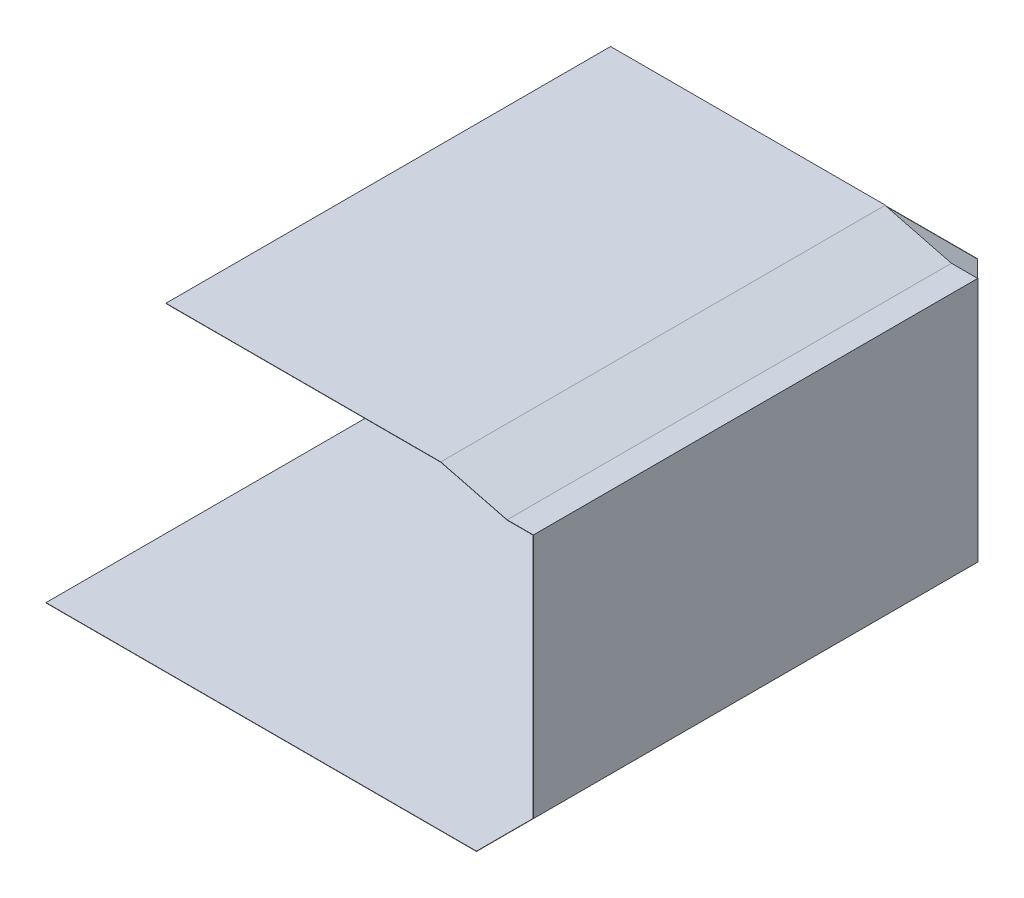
ISO-10303-21;
HEADER;
FILE_DESCRIPTION(('STEP AP214'),'2;1');
FILE_NAME('part.step','',(''),(''),'','','');
FILE_SCHEMA(('AUTOMOTIVE_DESIGN { 1 0 10303 214 1 1 1 1 }'));
ENDSEC;
DATA;
#1=APPLICATION_CONTEXT('core data for automotive mechanical design processes');
#2=APPLICATION_PROTOCOL_DEFINITION('international standard','automotive_design',2000,#1);
#3=PRODUCT_CONTEXT('',#1,'mechanical');
#4=PRODUCT('Part','Part','',(#3));
#5=PRODUCT_RELATED_PRODUCT_CATEGORY('part','',(#4));
#6=PRODUCT_DEFINITION_FORMATION('','',#4);
#7=PRODUCT_DEFINITION_CONTEXT('part definition',#1,'design');
#8=PRODUCT_DEFINITION('design','',#6,#7);
#9=PRODUCT_DEFINITION_SHAPE('','',#8);
#10=(LENGTH_UNIT() NAMED_UNIT(*) SI_UNIT(.MILLI.,.METRE.));
#11=(NAMED_UNIT(*) PLANE_ANGLE_UNIT() SI_UNIT($,.RADIAN.));
#12=(NAMED_UNIT(*) SI_UNIT($,.STERADIAN.) SOLID_ANGLE_UNIT());
#13=UNCERTAINTY_MEASURE_WITH_UNIT(LENGTH_MEASURE(1.E-05),#10,'distance_accuracy_value','');
#14=(GEOMETRIC_REPRESENTATION_CONTEXT(3) GLOBAL_UNCERTAINTY_ASSIGNED_CONTEXT((#13)) GLOBAL_UNIT_ASSIGNED_CONTEXT((#10,
#11,#12)) REPRESENTATION_CONTEXT('',''));
#15=CARTESIAN_POINT('',(0.,0.,0.));
#16=DIRECTION('',(0.,0.,1.));
#17=DIRECTION('',(1.,0.,0.));
#18=AXIS2_PLACEMENT_3D('',#15,#16,#17);
#19=CARTESIAN_POINT('',(328.732673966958,30.0898192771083,3657.6));
#20=DIRECTION('',(0.,1.,0.));
#21=DIRECTION('',(0.,0.,1.));
#22=AXIS2_PLACEMENT_3D('',#19,#20,#21);
#23=PLANE('',#22);
#24=DIRECTION('',(0.,0.,-1.));
#25=VECTOR('',#24,1.);
#26=CARTESIAN_POINT('',(328.732673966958,30.0898192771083,3657.6));
#27=LINE('',#26,#25);
#28=CARTESIAN_POINT('',(328.732673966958,30.0898192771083,3657.6));
#29=VERTEX_POINT('',#28);
#30=CARTESIAN_POINT('',(328.732673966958,30.0898192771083,2.54000000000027));
#31=VERTEX_POINT('',#30);
#32=EDGE_CURVE('E274',#29,#31,#27,.T.);
#33=ORIENTED_EDGE('',*,*,#32,.T.);
#34=DIRECTION('',(1.,0.,0.));
#35=VECTOR('',#34,1.);
#36=CARTESIAN_POINT('',(328.732673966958,30.0898192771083,2.54000000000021));
#37=LINE('',#36,#35);
#38=CARTESIAN_POINT('',(542.412409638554,30.0898192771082,2.54000000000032));
#39=VERTEX_POINT('',#38);
#40=EDGE_CURVE('E221',#31,#39,#37,.T.);
#41=ORIENTED_EDGE('',*,*,#40,.T.);
#42=DIRECTION('',(0.,0.,-1.));
#43=VECTOR('',#42,1.);
#44=CARTESIAN_POINT('',(542.412409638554,30.0898192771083,3657.6));
#45=LINE('',#44,#43);
#46=CARTESIAN_POINT('',(542.412409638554,30.0898192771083,3657.6));
#47=VERTEX_POINT('',#46);
#48=EDGE_CURVE('E60',#47,#39,#45,.T.);
#49=ORIENTED_EDGE('',*,*,#48,.F.);
#50=DIRECTION('',(1.,0.,0.));
#51=VECTOR('',#50,1.);
#52=CARTESIAN_POINT('',(328.732673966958,30.0898192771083,3657.6));
#53=LINE('',#52,#51);
#54=EDGE_CURVE('E242',#29,#47,#53,.T.);
#55=ORIENTED_EDGE('',*,*,#54,.F.);
#56=EDGE_LOOP('',(#33,#41,#49,#55));
#57=FACE_BOUND('',#56,.T.);
#58=ADVANCED_FACE('F37',(#57),#23,.F.);
#59=CARTESIAN_POINT('',(-2477.64759036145,172.329819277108,3657.6));
#60=DIRECTION('',(1.,0.,0.));
#61=DIRECTION('',(0.,0.,-1.));
#62=AXIS2_PLACEMENT_3D('',#59,#60,#61);
#63=PLANE('',#62);
#64=DIRECTION('',(0.,-1.,0.));
#65=VECTOR('',#64,1.);
#66=CARTESIAN_POINT('',(-2477.64759036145,172.329819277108,0.));
#67=LINE('',#66,#65);
#68=CARTESIAN_POINT('',(-2477.64759036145,172.329819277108,0.));
#69=VERTEX_POINT('',#68);
#70=CARTESIAN_POINT('',(-2477.64759036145,-1986.03518072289,0.));
#71=VERTEX_POINT('',#70);
#72=EDGE_CURVE('E233',#69,#71,#67,.T.);
#73=ORIENTED_EDGE('',*,*,#72,.T.);
#74=DIRECTION('',(0.,0.,1.));
#75=VECTOR('',#74,1.);
#76=CARTESIAN_POINT('',(-2477.64759036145,-1986.03518072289,0.));
#77=LINE('',#76,#75);
#78=CARTESIAN_POINT('',(-2477.64759036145,-1986.03518072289,2.53999999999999));
#79=VERTEX_POINT('',#78);
#80=EDGE_CURVE('E183',#71,#79,#77,.T.);
#81=ORIENTED_EDGE('',*,*,#80,.T.);
#82=DIRECTION('',(0.,-1.,0.));
#83=VECTOR('',#82,1.);
#84=CARTESIAN_POINT('',(-2477.64759036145,3189.85088740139,2.53999999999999));
#85=LINE('',#84,#83);
#86=CARTESIAN_POINT('',(-2477.64759036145,169.789819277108,2.53999999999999));
#87=VERTEX_POINT('',#86);
#88=EDGE_CURVE('E201',#87,#79,#85,.T.);
#89=ORIENTED_EDGE('',*,*,#88,.F.);
#90=DIRECTION('',(0.,0.,-1.));
#91=VECTOR('',#90,1.);
#92=CARTESIAN_POINT('',(-2477.64759036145,169.789819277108,3657.6));
#93=LINE('',#92,#91);
#94=CARTESIAN_POINT('',(-2477.64759036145,169.789819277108,3657.6));
#95=VERTEX_POINT('',#94);
#96=EDGE_CURVE('E11',#95,#87,#93,.T.);
#97=ORIENTED_EDGE('',*,*,#96,.F.);
#98=DIRECTION('',(0.,-1.,0.));
#99=VECTOR('',#98,1.);
#100=CARTESIAN_POINT('',(-2477.64759036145,172.329819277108,3657.6));
#101=LINE('',#100,#99);
#102=CARTESIAN_POINT('',(-2477.64759036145,172.329819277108,3657.6));
#103=VERTEX_POINT('',#102);
#104=EDGE_CURVE('E234',#103,#95,#101,.T.);
#105=ORIENTED_EDGE('',*,*,#104,.F.);
#106=DIRECTION('',(0.,0.,-1.));
#107=VECTOR('',#106,1.);
#108=CARTESIAN_POINT('',(-2477.64759036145,172.329819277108,3657.6));
#109=LINE('',#108,#107);
#110=EDGE_CURVE('E252',#103,#69,#109,.T.);
#111=ORIENTED_EDGE('',*,*,#110,.T.);
#112=EDGE_LOOP('',(#73,#81,#89,#97,#105,#111));
#113=FACE_BOUND('',#112,.T.);
#114=ADVANCED_FACE('F39',(#113),#63,.F.);
#115=CARTESIAN_POINT('',(-2477.64759036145,169.789819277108,3657.6));
#116=DIRECTION('',(0.,1.,0.));
#117=DIRECTION('',(0.,0.,1.));
#118=AXIS2_PLACEMENT_3D('',#115,#116,#117);
#119=PLANE('',#118);
#120=ORIENTED_EDGE('',*,*,#96,.T.);
#121=DIRECTION('',(-1.,0.,0.));
#122=VECTOR('',#121,1.);
#123=CARTESIAN_POINT('',(0.,169.789819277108,2.54000000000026));
#124=LINE('',#123,#122);
#125=CARTESIAN_POINT('',(-217.367326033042,169.789819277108,2.54000000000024));
#126=VERTEX_POINT('',#125);
#127=EDGE_CURVE('E186',#126,#87,#124,.T.);
#128=ORIENTED_EDGE('',*,*,#127,.F.);
#129=DIRECTION('',(0.,0.,-1.));
#130=VECTOR('',#129,1.);
#131=CARTESIAN_POINT('',(-217.367326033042,169.789819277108,3657.6));
#132=LINE('',#131,#130);
#133=CARTESIAN_POINT('',(-217.367326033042,169.789819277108,3657.6));
#134=VERTEX_POINT('',#133);
#135=EDGE_CURVE('E45',#134,#126,#132,.T.);
#136=ORIENTED_EDGE('',*,*,#135,.F.);
#137=DIRECTION('',(1.,0.,0.));
#138=VECTOR('',#137,1.);
#139=CARTESIAN_POINT('',(-2477.64759036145,169.789819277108,3657.6));
#140=LINE('',#139,#138);
#141=EDGE_CURVE('E237',#95,#134,#140,.T.);
#142=ORIENTED_EDGE('',*,*,#141,.F.);
#143=EDGE_LOOP('',(#120,#128,#136,#142));
#144=FACE_BOUND('',#143,.T.);
#145=ADVANCED_FACE('F284',(#144),#119,.F.);
#146=CARTESIAN_POINT('',(-217.367326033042,169.789819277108,3657.6));
#147=DIRECTION('',(0.247833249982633,0.968802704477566,0.));
#148=DIRECTION('',(-0.968802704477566,0.247833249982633,0.));
#149=AXIS2_PLACEMENT_3D('',#146,#147,#148);
#150=PLANE('',#149);
#151=ORIENTED_EDGE('',*,*,#135,.T.);
#152=DIRECTION('',(0.968802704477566,-0.247833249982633,0.));
#153=VECTOR('',#152,1.);
#154=CARTESIAN_POINT('',(-217.367326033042,169.789819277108,2.54000000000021));
#155=LINE('',#154,#153);
#156=EDGE_CURVE('E218',#126,#31,#155,.T.);
#157=ORIENTED_EDGE('',*,*,#156,.T.);
#158=ORIENTED_EDGE('',*,*,#32,.F.);
#159=DIRECTION('',(0.968802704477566,-0.247833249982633,0.));
#160=VECTOR('',#159,1.);
#161=CARTESIAN_POINT('',(-217.367326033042,169.789819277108,3657.6));
#162=LINE('',#161,#160);
#163=EDGE_CURVE('E240',#134,#29,#162,.T.);
#164=ORIENTED_EDGE('',*,*,#163,.F.);
#165=EDGE_LOOP('',(#151,#157,#158,#164));
#166=FACE_BOUND('',#165,.T.);
#167=ADVANCED_FACE('F280',(#166),#150,.F.);
#168=CARTESIAN_POINT('',(544.952409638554,32.6298192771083,3657.6));
#169=DIRECTION('',(-1.,0.,0.));
#170=DIRECTION('',(0.,0.,1.));
#171=AXIS2_PLACEMENT_3D('',#168,#169,#170);
#172=PLANE('',#171);
#173=DIRECTION('',(0.,1.,0.));
#174=VECTOR('',#173,1.);
#175=CARTESIAN_POINT('',(544.952409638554,32.6298192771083,0.));
#176=LINE('',#175,#174);
#177=CARTESIAN_POINT('',(544.952409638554,-1988.57518072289,0.));
#178=VERTEX_POINT('',#177);
#179=CARTESIAN_POINT('',(544.952409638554,32.6298192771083,0.));
#180=VERTEX_POINT('',#179);
#181=EDGE_CURVE('E255',#178,#180,#176,.T.);
#182=ORIENTED_EDGE('',*,*,#181,.T.);
#183=DIRECTION('',(0.,0.,-1.));
#184=VECTOR('',#183,1.);
#185=CARTESIAN_POINT('',(544.952409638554,32.6298192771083,3657.6));
#186=LINE('',#185,#184);
#187=CARTESIAN_POINT('',(544.952409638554,32.6298192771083,3657.6));
#188=VERTEX_POINT('',#187);
#189=EDGE_CURVE('E271',#188,#180,#186,.T.);
#190=ORIENTED_EDGE('',*,*,#189,.F.);
#191=DIRECTION('',(0.,1.,0.));
#192=VECTOR('',#191,1.);
#193=CARTESIAN_POINT('',(544.952409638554,32.6298192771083,3657.6));
#194=LINE('',#193,#192);
#195=CARTESIAN_POINT('',(544.952409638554,-1986.03518072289,3657.6));
#196=VERTEX_POINT('',#195);
#197=EDGE_CURVE('E244',#196,#188,#194,.T.);
#198=ORIENTED_EDGE('',*,*,#197,.F.);
#199=DIRECTION('',(0.,0.,1.));
#200=VECTOR('',#199,1.);
#201=CARTESIAN_POINT('',(544.952409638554,-1986.03518072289,0.));
#202=LINE('',#201,#200);
#203=CARTESIAN_POINT('',(544.952409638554,-1986.03518072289,4125.58962890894));
#204=VERTEX_POINT('',#203);
#205=EDGE_CURVE('E181',#196,#204,#202,.T.);
#206=ORIENTED_EDGE('',*,*,#205,.T.);
#207=DIRECTION('',(0.,1.,0.));
#208=VECTOR('',#207,1.);
#209=CARTESIAN_POINT('',(544.952409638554,-1988.57518072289,4125.58962890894));
#210=LINE('',#209,#208);
#211=CARTESIAN_POINT('',(544.952409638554,-1988.57518072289,4125.58962890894));
#212=VERTEX_POINT('',#211);
#213=EDGE_CURVE('E163',#212,#204,#210,.T.);
#214=ORIENTED_EDGE('',*,*,#213,.F.);
#215=DIRECTION('',(0.,0.,1.));
#216=VECTOR('',#215,1.);
#217=CARTESIAN_POINT('',(544.952409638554,-1988.57518072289,0.));
#218=LINE('',#217,#216);
#219=EDGE_CURVE('E169',#178,#212,#218,.T.);
#220=ORIENTED_EDGE('',*,*,#219,.F.);
#221=EDGE_LOOP('',(#182,#190,#198,#206,#214,#220));
#222=FACE_BOUND('',#221,.T.);
#223=ADVANCED_FACE('F179',(#222),#172,.F.);
#224=CARTESIAN_POINT('',(329.052409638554,32.6298192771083,3657.6));
#225=DIRECTION('',(0.,-1.,0.));
#226=DIRECTION('',(0.,0.,-1.));
#227=AXIS2_PLACEMENT_3D('',#224,#225,#226);
#228=PLANE('',#227);
#229=DIRECTION('',(0.,0.,-1.));
#230=VECTOR('',#229,1.);
#231=CARTESIAN_POINT('',(542.412409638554,32.6298192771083,3657.6));
#232=LINE('',#231,#230);
#233=CARTESIAN_POINT('',(542.412409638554,32.6298192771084,2.54000000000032));
#234=VERTEX_POINT('',#233);
#235=CARTESIAN_POINT('',(542.412409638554,32.6298192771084,0.));
#236=VERTEX_POINT('',#235);
#237=EDGE_CURVE('E197',#234,#236,#232,.T.);
#238=ORIENTED_EDGE('',*,*,#237,.F.);
#239=DIRECTION('',(-1.,0.,0.));
#240=VECTOR('',#239,1.);
#241=CARTESIAN_POINT('',(329.052409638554,32.6298192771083,2.54000000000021));
#242=LINE('',#241,#240);
#243=CARTESIAN_POINT('',(329.052409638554,32.6298192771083,2.54000000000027));
#244=VERTEX_POINT('',#243);
#245=EDGE_CURVE('E215',#234,#244,#242,.T.);
#246=ORIENTED_EDGE('',*,*,#245,.T.);
#247=DIRECTION('',(0.,0.,-1.));
#248=VECTOR('',#247,1.);
#249=CARTESIAN_POINT('',(329.052409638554,32.6298192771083,3657.6));
#250=LINE('',#249,#248);
#251=CARTESIAN_POINT('',(329.052409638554,32.6298192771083,3657.6));
#252=VERTEX_POINT('',#251);
#253=EDGE_CURVE('E268',#252,#244,#250,.T.);
#254=ORIENTED_EDGE('',*,*,#253,.F.);
#255=DIRECTION('',(-1.,0.,0.));
#256=VECTOR('',#255,1.);
#257=CARTESIAN_POINT('',(329.052409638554,32.6298192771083,3657.6));
#258=LINE('',#257,#256);
#259=EDGE_CURVE('E246',#188,#252,#258,.T.);
#260=ORIENTED_EDGE('',*,*,#259,.F.);
#261=ORIENTED_EDGE('',*,*,#189,.T.);
#262=DIRECTION('',(-1.,0.,0.));
#263=VECTOR('',#262,1.);
#264=CARTESIAN_POINT('',(329.052409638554,32.6298192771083,0.));
#265=LINE('',#264,#263);
#266=EDGE_CURVE('E257',#180,#236,#265,.T.);
#267=ORIENTED_EDGE('',*,*,#266,.T.);
#268=EDGE_LOOP('',(#238,#246,#254,#260,#261,#267));
#269=FACE_BOUND('',#268,.T.);
#270=ADVANCED_FACE('F319',(#269),#228,.F.);
#271=CARTESIAN_POINT('',(-217.047590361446,172.329819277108,3657.6));
#272=DIRECTION('',(-0.247833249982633,-0.968802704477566,0.));
#273=DIRECTION('',(0.968802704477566,-0.247833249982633,0.));
#274=AXIS2_PLACEMENT_3D('',#271,#272,#273);
#275=PLANE('',#274);
#276=ORIENTED_EDGE('',*,*,#253,.T.);
#277=DIRECTION('',(-0.968802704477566,0.247833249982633,0.));
#278=VECTOR('',#277,1.);
#279=CARTESIAN_POINT('',(-217.047590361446,172.329819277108,2.54000000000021));
#280=LINE('',#279,#278);
#281=CARTESIAN_POINT('',(-207.118499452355,169.789819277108,2.54000000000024));
#282=VERTEX_POINT('',#281);
#283=EDGE_CURVE('E212',#244,#282,#280,.T.);
#284=ORIENTED_EDGE('',*,*,#283,.T.);
#285=DIRECTION('',(0.,0.,-1.));
#286=VECTOR('',#285,1.);
#287=CARTESIAN_POINT('',(-207.118499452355,169.789819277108,3657.6));
#288=LINE('',#287,#286);
#289=CARTESIAN_POINT('',(-207.118499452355,169.789819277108,0.));
#290=VERTEX_POINT('',#289);
#291=EDGE_CURVE('E223',#282,#290,#288,.T.);
#292=ORIENTED_EDGE('',*,*,#291,.T.);
#293=DIRECTION('',(-0.968802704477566,0.247833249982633,0.));
#294=VECTOR('',#293,1.);
#295=CARTESIAN_POINT('',(-217.047590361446,172.329819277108,0.));
#296=LINE('',#295,#294);
#297=CARTESIAN_POINT('',(-217.047590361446,172.329819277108,0.));
#298=VERTEX_POINT('',#297);
#299=EDGE_CURVE('E260',#290,#298,#296,.T.);
#300=ORIENTED_EDGE('',*,*,#299,.T.);
#301=DIRECTION('',(0.,0.,-1.));
#302=VECTOR('',#301,1.);
#303=CARTESIAN_POINT('',(-217.047590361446,172.329819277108,3657.6));
#304=LINE('',#303,#302);
#305=CARTESIAN_POINT('',(-217.047590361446,172.329819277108,3657.6));
#306=VERTEX_POINT('',#305);
#307=EDGE_CURVE('E265',#306,#298,#304,.T.);
#308=ORIENTED_EDGE('',*,*,#307,.F.);
#309=DIRECTION('',(-0.968802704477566,0.247833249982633,0.));
#310=VECTOR('',#309,1.);
#311=CARTESIAN_POINT('',(-217.047590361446,172.329819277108,3657.6));
#312=LINE('',#311,#310);
#313=EDGE_CURVE('E248',#252,#306,#312,.T.);
#314=ORIENTED_EDGE('',*,*,#313,.F.);
#315=EDGE_LOOP('',(#276,#284,#292,#300,#308,#314));
#316=FACE_BOUND('',#315,.T.);
#317=ADVANCED_FACE('F369',(#316),#275,.F.);
#318=CARTESIAN_POINT('',(-2477.64759036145,172.329819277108,3657.6));
#319=DIRECTION('',(0.,-1.,0.));
#320=DIRECTION('',(0.,0.,-1.));
#321=AXIS2_PLACEMENT_3D('',#318,#319,#320);
#322=PLANE('',#321);
#323=DIRECTION('',(-1.,0.,0.));
#324=VECTOR('',#323,1.);
#325=CARTESIAN_POINT('',(-2477.64759036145,172.329819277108,0.));
#326=LINE('',#325,#324);
#327=EDGE_CURVE('E238',#298,#69,#326,.T.);
#328=ORIENTED_EDGE('',*,*,#327,.T.);
#329=ORIENTED_EDGE('',*,*,#110,.F.);
#330=DIRECTION('',(-1.,0.,0.));
#331=VECTOR('',#330,1.);
#332=CARTESIAN_POINT('',(-2477.64759036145,172.329819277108,3657.6));
#333=LINE('',#332,#331);
#334=EDGE_CURVE('E250',#306,#103,#333,.T.);
#335=ORIENTED_EDGE('',*,*,#334,.F.);
#336=ORIENTED_EDGE('',*,*,#307,.T.);
#337=EDGE_LOOP('',(#328,#329,#335,#336));
#338=FACE_BOUND('',#337,.T.);
#339=ADVANCED_FACE('F375',(#338),#322,.F.);
#340=CARTESIAN_POINT('',(0.,0.,3657.6));
#341=DIRECTION('',(0.,0.,1.));
#342=DIRECTION('',(1.,0.,0.));
#343=AXIS2_PLACEMENT_3D('',#340,#341,#342);
#344=PLANE('',#343);
#345=ORIENTED_EDGE('',*,*,#104,.T.);
#346=ORIENTED_EDGE('',*,*,#141,.T.);
#347=ORIENTED_EDGE('',*,*,#163,.T.);
#348=ORIENTED_EDGE('',*,*,#54,.T.);
#349=DIRECTION('',(0.,1.,0.));
#350=VECTOR('',#349,1.);
#351=CARTESIAN_POINT('',(542.412409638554,-1986.03518072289,3657.6));
#352=LINE('',#351,#350);
#353=CARTESIAN_POINT('',(542.412409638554,-1986.03518072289,3657.6));
#354=VERTEX_POINT('',#353);
#355=EDGE_CURVE('E229',#354,#47,#352,.T.);
#356=ORIENTED_EDGE('',*,*,#355,.F.);
#357=DIRECTION('',(-1.,0.,0.));
#358=VECTOR('',#357,1.);
#359=CARTESIAN_POINT('',(544.952409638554,-1986.03518072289,3657.6));
#360=LINE('',#359,#358);
#361=EDGE_CURVE('E225',#196,#354,#360,.T.);
#362=ORIENTED_EDGE('',*,*,#361,.F.);
#363=ORIENTED_EDGE('',*,*,#197,.T.);
#364=ORIENTED_EDGE('',*,*,#259,.T.);
#365=ORIENTED_EDGE('',*,*,#313,.T.);
#366=ORIENTED_EDGE('',*,*,#334,.T.);
#367=EDGE_LOOP('',(#345,#346,#347,#348,#356,#362,#363,#364,#365,#366));
#368=FACE_BOUND('',#367,.T.);
#369=ADVANCED_FACE('F323',(#368),#344,.T.);
#370=CARTESIAN_POINT('',(0.,0.,0.));
#371=DIRECTION('',(0.,0.,1.));
#372=DIRECTION('',(1.,0.,0.));
#373=AXIS2_PLACEMENT_3D('',#370,#371,#372);
#374=PLANE('',#373);
#375=ORIENTED_EDGE('',*,*,#299,.F.);
#376=DIRECTION('',(-1.,0.,0.));
#377=VECTOR('',#376,1.);
#378=CARTESIAN_POINT('',(0.,169.789819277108,0.));
#379=LINE('',#378,#377);
#380=CARTESIAN_POINT('',(542.412409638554,169.789819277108,0.));
#381=VERTEX_POINT('',#380);
#382=EDGE_CURVE('E52',#381,#290,#379,.T.);
#383=ORIENTED_EDGE('',*,*,#382,.F.);
#384=DIRECTION('',(0.,-1.,0.));
#385=VECTOR('',#384,1.);
#386=CARTESIAN_POINT('',(542.412409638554,3189.85088740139,0.));
#387=LINE('',#386,#385);
#388=EDGE_CURVE('E193',#381,#236,#387,.T.);
#389=ORIENTED_EDGE('',*,*,#388,.T.);
#390=ORIENTED_EDGE('',*,*,#266,.F.);
#391=ORIENTED_EDGE('',*,*,#181,.F.);
#392=DIRECTION('',(1.,0.,0.));
#393=VECTOR('',#392,1.);
#394=CARTESIAN_POINT('',(544.952409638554,-1988.57518072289,0.));
#395=LINE('',#394,#393);
#396=CARTESIAN_POINT('',(-2996.46156787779,-1988.57518072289,0.));
#397=VERTEX_POINT('',#396);
#398=EDGE_CURVE('E175',#397,#178,#395,.T.);
#399=ORIENTED_EDGE('',*,*,#398,.F.);
#400=DIRECTION('',(0.,1.,0.));
#401=VECTOR('',#400,1.);
#402=CARTESIAN_POINT('',(-2996.46156787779,-1988.57518072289,0.));
#403=LINE('',#402,#401);
#404=CARTESIAN_POINT('',(-2996.46156787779,-1986.03518072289,0.));
#405=VERTEX_POINT('',#404);
#406=EDGE_CURVE('E188',#397,#405,#403,.T.);
#407=ORIENTED_EDGE('',*,*,#406,.T.);
#408=DIRECTION('',(1.,0.,0.));
#409=VECTOR('',#408,1.);
#410=CARTESIAN_POINT('',(544.952409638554,-1986.03518072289,0.));
#411=LINE('',#410,#409);
#412=EDGE_CURVE('E177',#405,#71,#411,.T.);
#413=ORIENTED_EDGE('',*,*,#412,.T.);
#414=ORIENTED_EDGE('',*,*,#72,.F.);
#415=ORIENTED_EDGE('',*,*,#327,.F.);
#416=EDGE_LOOP('',(#375,#383,#389,#390,#391,#399,#407,#413,#414,#415));
#417=FACE_BOUND('',#416,.T.);
#418=ADVANCED_FACE('F301',(#417),#374,.F.);
#419=CARTESIAN_POINT('',(542.412409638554,-1986.03518072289,3657.6));
#420=DIRECTION('',(1.,0.,0.));
#421=DIRECTION('',(0.,0.,-1.));
#422=AXIS2_PLACEMENT_3D('',#419,#420,#421);
#423=PLANE('',#422);
#424=ORIENTED_EDGE('',*,*,#48,.T.);
#425=DIRECTION('',(0.,-1.,0.));
#426=VECTOR('',#425,1.);
#427=CARTESIAN_POINT('',(542.412409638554,3189.85088740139,2.54000000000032));
#428=LINE('',#427,#426);
#429=CARTESIAN_POINT('',(542.412409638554,-1986.03518072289,2.54000000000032));
#430=VERTEX_POINT('',#429);
#431=EDGE_CURVE('E205',#39,#430,#428,.T.);
#432=ORIENTED_EDGE('',*,*,#431,.T.);
#433=DIRECTION('',(0.,0.,-1.));
#434=VECTOR('',#433,1.);
#435=CARTESIAN_POINT('',(542.412409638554,-1986.03518072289,3657.6));
#436=LINE('',#435,#434);
#437=EDGE_CURVE('E227',#354,#430,#436,.T.);
#438=ORIENTED_EDGE('',*,*,#437,.F.);
#439=ORIENTED_EDGE('',*,*,#355,.T.);
#440=EDGE_LOOP('',(#424,#432,#438,#439));
#441=FACE_BOUND('',#440,.T.);
#442=ADVANCED_FACE('F330',(#441),#423,.F.);
#443=CARTESIAN_POINT('',(0.,3189.85088740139,2.54000000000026));
#444=DIRECTION('',(0.,0.,1.));
#445=DIRECTION('',(1.,0.,0.));
#446=AXIS2_PLACEMENT_3D('',#443,#444,#445);
#447=PLANE('',#446);
#448=ORIENTED_EDGE('',*,*,#40,.F.);
#449=ORIENTED_EDGE('',*,*,#156,.F.);
#450=ORIENTED_EDGE('',*,*,#127,.T.);
#451=ORIENTED_EDGE('',*,*,#88,.T.);
#452=DIRECTION('',(-1.,0.,0.));
#453=VECTOR('',#452,1.);
#454=CARTESIAN_POINT('',(0.,-1986.03518072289,2.54000000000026));
#455=LINE('',#454,#453);
#456=EDGE_CURVE('E192',#430,#79,#455,.T.);
#457=ORIENTED_EDGE('',*,*,#456,.F.);
#458=ORIENTED_EDGE('',*,*,#431,.F.);
#459=EDGE_LOOP('',(#448,#449,#450,#451,#457,#458));
#460=FACE_BOUND('',#459,.T.);
#461=ADVANCED_FACE('F288',(#460),#447,.T.);
#462=CARTESIAN_POINT('',(-2477.64759036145,169.789819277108,3657.6));
#463=DIRECTION('',(0.,1.,0.));
#464=DIRECTION('',(0.,0.,1.));
#465=AXIS2_PLACEMENT_3D('',#462,#463,#464);
#466=PLANE('',#465);
#467=ORIENTED_EDGE('',*,*,#291,.F.);
#468=CARTESIAN_POINT('',(542.412409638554,169.789819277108,2.54000000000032));
#469=VERTEX_POINT('',#468);
#470=EDGE_CURVE('E198',#469,#282,#124,.T.);
#471=ORIENTED_EDGE('',*,*,#470,.F.);
#472=DIRECTION('',(0.,0.,-1.));
#473=VECTOR('',#472,1.);
#474=CARTESIAN_POINT('',(542.412409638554,169.789819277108,0.));
#475=LINE('',#474,#473);
#476=EDGE_CURVE('E195',#469,#381,#475,.T.);
#477=ORIENTED_EDGE('',*,*,#476,.T.);
#478=ORIENTED_EDGE('',*,*,#382,.T.);
#479=EDGE_LOOP('',(#467,#471,#477,#478));
#480=FACE_BOUND('',#479,.T.);
#481=ADVANCED_FACE('F337',(#480),#466,.T.);
#482=ORIENTED_EDGE('',*,*,#245,.F.);
#483=EDGE_CURVE('E206',#469,#234,#428,.T.);
#484=ORIENTED_EDGE('',*,*,#483,.F.);
#485=ORIENTED_EDGE('',*,*,#470,.T.);
#486=ORIENTED_EDGE('',*,*,#283,.F.);
#487=EDGE_LOOP('',(#482,#484,#485,#486));
#488=FACE_BOUND('',#487,.T.);
#489=ADVANCED_FACE('F339',(#488),#447,.T.);
#490=CARTESIAN_POINT('',(542.412409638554,3189.85088740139,0.));
#491=DIRECTION('',(-1.,0.,0.));
#492=DIRECTION('',(0.,0.,1.));
#493=AXIS2_PLACEMENT_3D('',#490,#491,#492);
#494=PLANE('',#493);
#495=ORIENTED_EDGE('',*,*,#483,.T.);
#496=ORIENTED_EDGE('',*,*,#237,.T.);
#497=ORIENTED_EDGE('',*,*,#388,.F.);
#498=ORIENTED_EDGE('',*,*,#476,.F.);
#499=EDGE_LOOP('',(#495,#496,#497,#498));
#500=FACE_BOUND('',#499,.T.);
#501=ADVANCED_FACE('F418',(#500),#494,.F.);
#502=CARTESIAN_POINT('',(0.,-1986.03518072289,0.));
#503=DIRECTION('',(0.,-1.,0.));
#504=DIRECTION('',(0.,0.,-1.));
#505=AXIS2_PLACEMENT_3D('',#502,#503,#504);
#506=PLANE('',#505);
#507=ORIENTED_EDGE('',*,*,#205,.F.);
#508=ORIENTED_EDGE('',*,*,#361,.T.);
#509=ORIENTED_EDGE('',*,*,#437,.T.);
#510=ORIENTED_EDGE('',*,*,#456,.T.);
#511=ORIENTED_EDGE('',*,*,#80,.F.);
#512=ORIENTED_EDGE('',*,*,#412,.F.);
#513=DIRECTION('',(0.,0.,-1.));
#514=VECTOR('',#513,1.);
#515=CARTESIAN_POINT('',(-2996.46156787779,-1986.03518072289,0.));
#516=LINE('',#515,#514);
#517=CARTESIAN_POINT('',(-2996.46156787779,-1986.03518072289,4125.58962890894));
#518=VERTEX_POINT('',#517);
#519=EDGE_CURVE('E304',#518,#405,#516,.T.);
#520=ORIENTED_EDGE('',*,*,#519,.F.);
#521=DIRECTION('',(-1.,0.,0.));
#522=VECTOR('',#521,1.);
#523=CARTESIAN_POINT('',(544.952409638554,-1986.03518072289,4125.58962890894));
#524=LINE('',#523,#522);
#525=EDGE_CURVE('E306',#204,#518,#524,.T.);
#526=ORIENTED_EDGE('',*,*,#525,.F.);
#527=EDGE_LOOP('',(#507,#508,#509,#510,#511,#512,#520,#526));
#528=FACE_BOUND('',#527,.T.);
#529=ADVANCED_FACE('F296',(#528),#506,.F.);
#530=CARTESIAN_POINT('',(544.952409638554,-1988.57518072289,4125.58962890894));
#531=DIRECTION('',(0.,0.,-1.));
#532=DIRECTION('',(-1.,0.,0.));
#533=AXIS2_PLACEMENT_3D('',#530,#531,#532);
#534=PLANE('',#533);
#535=ORIENTED_EDGE('',*,*,#525,.T.);
#536=DIRECTION('',(0.,1.,0.));
#537=VECTOR('',#536,1.);
#538=CARTESIAN_POINT('',(-2996.46156787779,-1988.57518072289,4125.58962890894));
#539=LINE('',#538,#537);
#540=CARTESIAN_POINT('',(-2996.46156787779,-1988.57518072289,4125.58962890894));
#541=VERTEX_POINT('',#540);
#542=EDGE_CURVE('E165',#541,#518,#539,.T.);
#543=ORIENTED_EDGE('',*,*,#542,.F.);
#544=DIRECTION('',(-1.,0.,0.));
#545=VECTOR('',#544,1.);
#546=CARTESIAN_POINT('',(544.952409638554,-1988.57518072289,4125.58962890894));
#547=LINE('',#546,#545);
#548=EDGE_CURVE('E159',#212,#541,#547,.T.);
#549=ORIENTED_EDGE('',*,*,#548,.F.);
#550=ORIENTED_EDGE('',*,*,#213,.T.);
#551=EDGE_LOOP('',(#535,#543,#549,#550));
#552=FACE_BOUND('',#551,.T.);
#553=ADVANCED_FACE('F161',(#552),#534,.F.);
#554=CARTESIAN_POINT('',(-2996.46156787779,-1988.57518072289,0.));
#555=DIRECTION('',(1.,0.,0.));
#556=DIRECTION('',(0.,0.,-1.));
#557=AXIS2_PLACEMENT_3D('',#554,#555,#556);
#558=PLANE('',#557);
#559=ORIENTED_EDGE('',*,*,#519,.T.);
#560=ORIENTED_EDGE('',*,*,#406,.F.);
#561=DIRECTION('',(0.,0.,-1.));
#562=VECTOR('',#561,1.);
#563=CARTESIAN_POINT('',(-2996.46156787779,-1988.57518072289,0.));
#564=LINE('',#563,#562);
#565=EDGE_CURVE('E168',#541,#397,#564,.T.);
#566=ORIENTED_EDGE('',*,*,#565,.F.);
#567=ORIENTED_EDGE('',*,*,#542,.T.);
#568=EDGE_LOOP('',(#559,#560,#566,#567));
#569=FACE_BOUND('',#568,.T.);
#570=ADVANCED_FACE('F313',(#569),#558,.F.);
#571=CARTESIAN_POINT('',(0.,-1988.57518072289,0.));
#572=DIRECTION('',(0.,-1.,0.));
#573=DIRECTION('',(0.,0.,-1.));
#574=AXIS2_PLACEMENT_3D('',#571,#572,#573);
#575=PLANE('',#574);
#576=ORIENTED_EDGE('',*,*,#219,.T.);
#577=ORIENTED_EDGE('',*,*,#548,.T.);
#578=ORIENTED_EDGE('',*,*,#565,.T.);
#579=ORIENTED_EDGE('',*,*,#398,.T.);
#580=EDGE_LOOP('',(#576,#577,#578,#579));
#581=FACE_BOUND('',#580,.T.);
#582=ADVANCED_FACE('F173',(#581),#575,.T.);
#583=CLOSED_SHELL('',(#58,#114,#145,#167,#223,#270,#317,#339,#369,#418,#442,#461,#481,#489,#501,
#529,#553,#570,#582));
#584=MANIFOLD_SOLID_BREP('B2',#583);
#585=ADVANCED_BREP_SHAPE_REPRESENTATION('',(#18,#584),#14);
#586=SHAPE_DEFINITION_REPRESENTATION(#9,#585);
ENDSEC;
END-ISO-10303-21;
